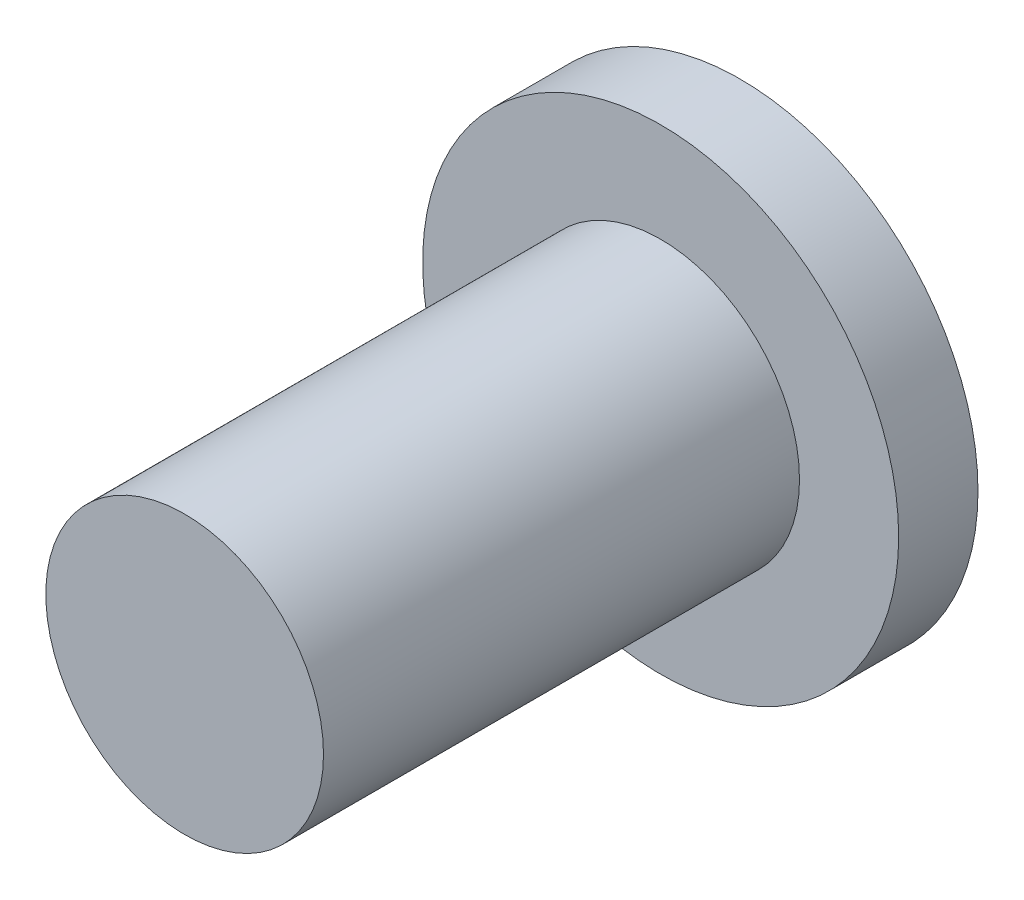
from build123d import *

# Parameters (mm, degrees)
ESQUISSE1_R             = 6
BOSS_EXTRU_1_DEPTH      = 14
ESQUISSE2_OUTSIDE_W     = 18.4
ESQUISSE2_OUTSIDE_H     = 18.4
ESQUISSE2_OUTSIDE_R     = 3.5
ENL_V_MAT_EXTRU_2_DEPTH = 12


with BuildPart() as part:
    # Esquisse1 → Boss.-Extru.1 (new body)
    with BuildSketch(Plane.XY):
        Circle(ESQUISSE1_R)
    extrude(amount=BOSS_EXTRU_1_DEPTH)

    # Esquisse2 outside → Enl_v. mat.-Extru.2 (cut)
    with BuildSketch(Plane.XY.offset(14)):
        Rectangle(ESQUISSE2_OUTSIDE_W, ESQUISSE2_OUTSIDE_H)
        Circle(ESQUISSE2_OUTSIDE_R, mode=Mode.SUBTRACT)
    extrude(amount=-ENL_V_MAT_EXTRU_2_DEPTH, mode=Mode.SUBTRACT)


solid = part.part
